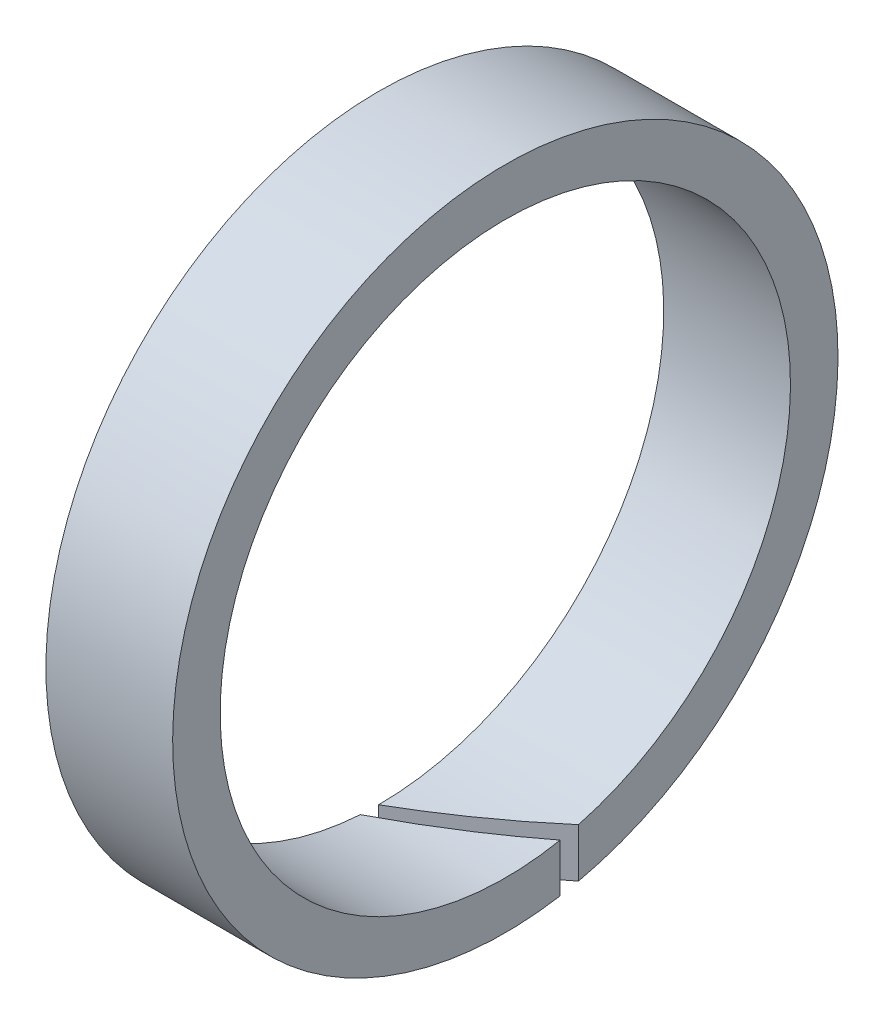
from build123d import *

# Parameters (mm, degrees)
ESQUISSE1_W             = 4
ESQUISSE1_H             = 1.5
ENL_V_MAT_EXTRU_1_DEPTH = 16.378556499


with BuildPart() as part:
    # Esquisse1 → R_volution1 (revolve)
    with BuildSketch(Plane.XY, mode=Mode.PRIVATE) as r_volution1_sk:
        with Locations((2, 9.75)):
            Rectangle(ESQUISSE1_W, ESQUISSE1_H)
    revolve(r_volution1_sk.sketch.rotate(Axis((0, 0, 0), (1, 0, 0)), 90), axis=Axis((0, 0, 0), (1, 0, 0)))

    # Esquisse2 → Enl_v. mat.-Extru.1 (cut, through all)
    with BuildSketch(Plane(origin=(0, 0, 0), x_dir=(1, 0, 0), z_dir=(0, 1, 0))):
        Polygon((0, 0), (4, 2.309401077), (4, 1.732050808), (0, -0.577350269), align=None)
    extrude(amount=-ENL_V_MAT_EXTRU_1_DEPTH, mode=Mode.SUBTRACT)


solid = part.part
